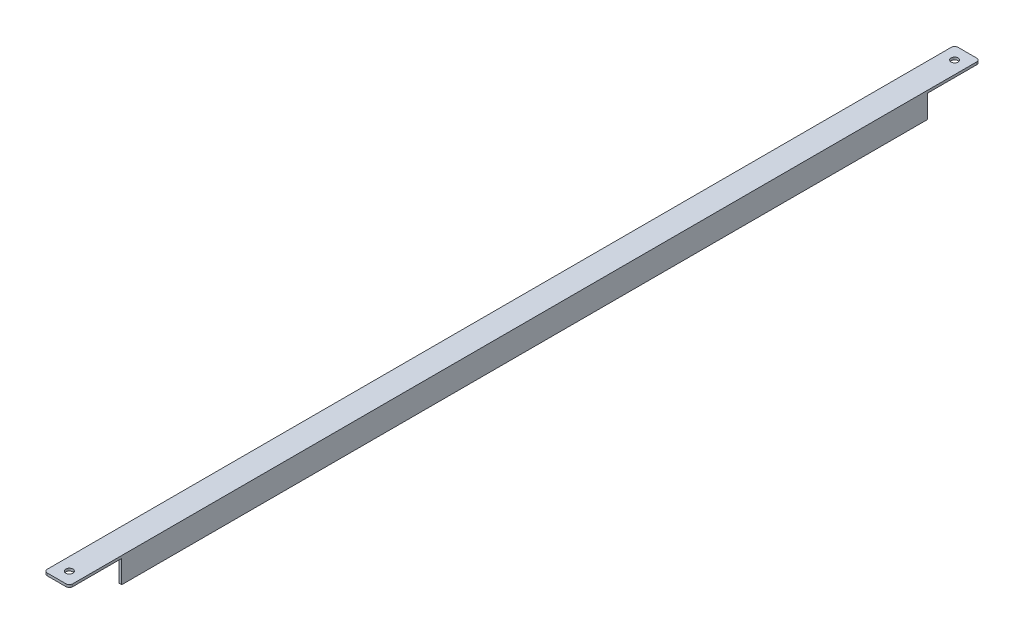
ISO-10303-21;
HEADER;
FILE_DESCRIPTION(('STEP AP214'),'2;1');
FILE_NAME('part.step','',(''),(''),'','','');
FILE_SCHEMA(('AUTOMOTIVE_DESIGN { 1 0 10303 214 1 1 1 1 }'));
ENDSEC;
DATA;
#1=APPLICATION_CONTEXT('core data for automotive mechanical design processes');
#2=APPLICATION_PROTOCOL_DEFINITION('international standard','automotive_design',2000,#1);
#3=PRODUCT_CONTEXT('',#1,'mechanical');
#4=PRODUCT('Part','Part','',(#3));
#5=PRODUCT_RELATED_PRODUCT_CATEGORY('part','',(#4));
#6=PRODUCT_DEFINITION_FORMATION('','',#4);
#7=PRODUCT_DEFINITION_CONTEXT('part definition',#1,'design');
#8=PRODUCT_DEFINITION('design','',#6,#7);
#9=PRODUCT_DEFINITION_SHAPE('','',#8);
#10=(LENGTH_UNIT() NAMED_UNIT(*) SI_UNIT(.MILLI.,.METRE.));
#11=(NAMED_UNIT(*) PLANE_ANGLE_UNIT() SI_UNIT($,.RADIAN.));
#12=(NAMED_UNIT(*) SI_UNIT($,.STERADIAN.) SOLID_ANGLE_UNIT());
#13=UNCERTAINTY_MEASURE_WITH_UNIT(LENGTH_MEASURE(1.E-05),#10,'distance_accuracy_value','');
#14=(GEOMETRIC_REPRESENTATION_CONTEXT(3) GLOBAL_UNCERTAINTY_ASSIGNED_CONTEXT((#13)) GLOBAL_UNIT_ASSIGNED_CONTEXT((#10,
#11,#12)) REPRESENTATION_CONTEXT('',''));
#15=CARTESIAN_POINT('',(0.,0.,0.));
#16=DIRECTION('',(0.,0.,1.));
#17=DIRECTION('',(1.,0.,0.));
#18=AXIS2_PLACEMENT_3D('',#15,#16,#17);
#19=CARTESIAN_POINT('',(-15.,-15.,539.));
#20=DIRECTION('',(0.,1.,0.));
#21=DIRECTION('',(0.,0.,1.));
#22=AXIS2_PLACEMENT_3D('',#19,#20,#21);
#23=PLANE('',#22);
#24=DIRECTION('',(1.,0.,0.));
#25=VECTOR('',#24,1.);
#26=CARTESIAN_POINT('',(-15.,-15.,477.));
#27=LINE('',#26,#25);
#28=CARTESIAN_POINT('',(12.,-15.,477.));
#29=VERTEX_POINT('',#28);
#30=CARTESIAN_POINT('',(15.,-15.,477.));
#31=VERTEX_POINT('',#30);
#32=EDGE_CURVE('E168',#29,#31,#27,.T.);
#33=ORIENTED_EDGE('',*,*,#32,.F.);
#34=DIRECTION('',(0.,0.,1.));
#35=VECTOR('',#34,1.);
#36=CARTESIAN_POINT('',(12.,-15.,-539.));
#37=LINE('',#36,#35);
#38=CARTESIAN_POINT('',(12.,-15.,-477.));
#39=VERTEX_POINT('',#38);
#40=EDGE_CURVE('E236',#39,#29,#37,.T.);
#41=ORIENTED_EDGE('',*,*,#40,.F.);
#42=DIRECTION('',(1.,0.,0.));
#43=VECTOR('',#42,1.);
#44=CARTESIAN_POINT('',(-15.,-15.,-477.));
#45=LINE('',#44,#43);
#46=CARTESIAN_POINT('',(15.,-15.,-477.));
#47=VERTEX_POINT('',#46);
#48=EDGE_CURVE('E259',#39,#47,#45,.T.);
#49=ORIENTED_EDGE('',*,*,#48,.T.);
#50=DIRECTION('',(0.,0.,-1.));
#51=VECTOR('',#50,1.);
#52=CARTESIAN_POINT('',(15.,-15.,539.));
#53=LINE('',#52,#51);
#54=EDGE_CURVE('E175',#31,#47,#53,.T.);
#55=ORIENTED_EDGE('',*,*,#54,.F.);
#56=EDGE_LOOP('',(#33,#41,#49,#55));
#57=FACE_BOUND('',#56,.T.);
#58=ADVANCED_FACE('F34',(#57),#23,.F.);
#59=CARTESIAN_POINT('',(15.,-15.,539.));
#60=DIRECTION('',(-1.,0.,0.));
#61=DIRECTION('',(0.,0.,1.));
#62=AXIS2_PLACEMENT_3D('',#59,#60,#61);
#63=PLANE('',#62);
#64=DIRECTION('',(0.,0.,-1.));
#65=VECTOR('',#64,1.);
#66=CARTESIAN_POINT('',(15.,15.,539.));
#67=LINE('',#66,#65);
#68=CARTESIAN_POINT('',(15.,15.,535.));
#69=VERTEX_POINT('',#68);
#70=CARTESIAN_POINT('',(15.,15.,-535.));
#71=VERTEX_POINT('',#70);
#72=EDGE_CURVE('E178',#69,#71,#67,.T.);
#73=ORIENTED_EDGE('',*,*,#72,.F.);
#74=DIRECTION('',(0.,1.,0.));
#75=VECTOR('',#74,1.);
#76=CARTESIAN_POINT('',(15.,-15.,535.));
#77=LINE('',#76,#75);
#78=CARTESIAN_POINT('',(15.,12.,535.));
#79=VERTEX_POINT('',#78);
#80=EDGE_CURVE('E212',#69,#79,#77,.F.);
#81=ORIENTED_EDGE('',*,*,#80,.T.);
#82=DIRECTION('',(0.,0.,-1.));
#83=VECTOR('',#82,1.);
#84=CARTESIAN_POINT('',(15.,12.,539.));
#85=LINE('',#84,#83);
#86=CARTESIAN_POINT('',(15.,12.,477.));
#87=VERTEX_POINT('',#86);
#88=EDGE_CURVE('E157',#79,#87,#85,.T.);
#89=ORIENTED_EDGE('',*,*,#88,.T.);
#90=DIRECTION('',(0.,-1.,0.));
#91=VECTOR('',#90,1.);
#92=CARTESIAN_POINT('',(15.,-15.,477.));
#93=LINE('',#92,#91);
#94=EDGE_CURVE('E190',#87,#31,#93,.T.);
#95=ORIENTED_EDGE('',*,*,#94,.T.);
#96=ORIENTED_EDGE('',*,*,#54,.T.);
#97=DIRECTION('',(0.,-1.,0.));
#98=VECTOR('',#97,1.);
#99=CARTESIAN_POINT('',(15.,-15.,-477.));
#100=LINE('',#99,#98);
#101=CARTESIAN_POINT('',(15.,12.,-477.));
#102=VERTEX_POINT('',#101);
#103=EDGE_CURVE('E244',#102,#47,#100,.T.);
#104=ORIENTED_EDGE('',*,*,#103,.F.);
#105=DIRECTION('',(0.,0.,1.));
#106=VECTOR('',#105,1.);
#107=CARTESIAN_POINT('',(15.,12.,-539.));
#108=LINE('',#107,#106);
#109=CARTESIAN_POINT('',(15.,12.,-535.));
#110=VERTEX_POINT('',#109);
#111=EDGE_CURVE('E249',#110,#102,#108,.T.);
#112=ORIENTED_EDGE('',*,*,#111,.F.);
#113=DIRECTION('',(0.,1.,0.));
#114=VECTOR('',#113,1.);
#115=CARTESIAN_POINT('',(15.,15.,-535.));
#116=LINE('',#115,#114);
#117=EDGE_CURVE('E209',#110,#71,#116,.T.);
#118=ORIENTED_EDGE('',*,*,#117,.T.);
#119=EDGE_LOOP('',(#73,#81,#89,#95,#96,#104,#112,#118));
#120=FACE_BOUND('',#119,.T.);
#121=ADVANCED_FACE('F317',(#120),#63,.F.);
#122=CARTESIAN_POINT('',(-15.,-15.,539.));
#123=DIRECTION('',(1.,0.,0.));
#124=DIRECTION('',(0.,0.,-1.));
#125=AXIS2_PLACEMENT_3D('',#122,#123,#124);
#126=PLANE('',#125);
#127=DIRECTION('',(0.,0.,-1.));
#128=VECTOR('',#127,1.);
#129=CARTESIAN_POINT('',(-15.,12.,539.));
#130=LINE('',#129,#128);
#131=CARTESIAN_POINT('',(-15.,12.,535.));
#132=VERTEX_POINT('',#131);
#133=CARTESIAN_POINT('',(-15.,12.,477.));
#134=VERTEX_POINT('',#133);
#135=EDGE_CURVE('E156',#132,#134,#130,.T.);
#136=ORIENTED_EDGE('',*,*,#135,.F.);
#137=DIRECTION('',(0.,-1.,0.));
#138=VECTOR('',#137,1.);
#139=CARTESIAN_POINT('',(-15.,-15.,535.));
#140=LINE('',#139,#138);
#141=CARTESIAN_POINT('',(-15.,15.,535.));
#142=VERTEX_POINT('',#141);
#143=EDGE_CURVE('E224',#132,#142,#140,.F.);
#144=ORIENTED_EDGE('',*,*,#143,.T.);
#145=DIRECTION('',(0.,0.,-1.));
#146=VECTOR('',#145,1.);
#147=CARTESIAN_POINT('',(-15.,15.,539.));
#148=LINE('',#147,#146);
#149=CARTESIAN_POINT('',(-15.,15.,-535.));
#150=VERTEX_POINT('',#149);
#151=EDGE_CURVE('E174',#142,#150,#148,.T.);
#152=ORIENTED_EDGE('',*,*,#151,.T.);
#153=DIRECTION('',(0.,-1.,0.));
#154=VECTOR('',#153,1.);
#155=CARTESIAN_POINT('',(-15.,12.,-535.));
#156=LINE('',#155,#154);
#157=CARTESIAN_POINT('',(-15.,12.,-535.));
#158=VERTEX_POINT('',#157);
#159=EDGE_CURVE('E221',#150,#158,#156,.T.);
#160=ORIENTED_EDGE('',*,*,#159,.T.);
#161=DIRECTION('',(0.,0.,1.));
#162=VECTOR('',#161,1.);
#163=CARTESIAN_POINT('',(-15.,12.,-539.));
#164=LINE('',#163,#162);
#165=CARTESIAN_POINT('',(-15.,12.,-477.));
#166=VERTEX_POINT('',#165);
#167=EDGE_CURVE('E238',#158,#166,#164,.T.);
#168=ORIENTED_EDGE('',*,*,#167,.T.);
#169=DIRECTION('',(0.,-1.,0.));
#170=VECTOR('',#169,1.);
#171=CARTESIAN_POINT('',(-15.,-15.,-477.));
#172=LINE('',#171,#170);
#173=CARTESIAN_POINT('',(-15.,-15.,-477.));
#174=VERTEX_POINT('',#173);
#175=EDGE_CURVE('E173',#166,#174,#172,.T.);
#176=ORIENTED_EDGE('',*,*,#175,.T.);
#177=DIRECTION('',(0.,0.,-1.));
#178=VECTOR('',#177,1.);
#179=CARTESIAN_POINT('',(-15.,-15.,539.));
#180=LINE('',#179,#178);
#181=CARTESIAN_POINT('',(-15.,-15.,477.));
#182=VERTEX_POINT('',#181);
#183=EDGE_CURVE('E163',#182,#174,#180,.T.);
#184=ORIENTED_EDGE('',*,*,#183,.F.);
#185=DIRECTION('',(0.,-1.,0.));
#186=VECTOR('',#185,1.);
#187=CARTESIAN_POINT('',(-15.,-15.,477.));
#188=LINE('',#187,#186);
#189=EDGE_CURVE('E146',#134,#182,#188,.T.);
#190=ORIENTED_EDGE('',*,*,#189,.F.);
#191=EDGE_LOOP('',(#136,#144,#152,#160,#168,#176,#184,#190));
#192=FACE_BOUND('',#191,.T.);
#193=ADVANCED_FACE('F171',(#192),#126,.F.);
#194=CARTESIAN_POINT('',(-12.,-15.,477.));
#195=VERTEX_POINT('',#194);
#196=EDGE_CURVE('E149',#182,#195,#27,.T.);
#197=ORIENTED_EDGE('',*,*,#196,.F.);
#198=ORIENTED_EDGE('',*,*,#183,.T.);
#199=CARTESIAN_POINT('',(-12.,-15.,-477.));
#200=VERTEX_POINT('',#199);
#201=EDGE_CURVE('E256',#174,#200,#45,.T.);
#202=ORIENTED_EDGE('',*,*,#201,.T.);
#203=DIRECTION('',(0.,0.,1.));
#204=VECTOR('',#203,1.);
#205=CARTESIAN_POINT('',(-12.,-15.,-539.));
#206=LINE('',#205,#204);
#207=EDGE_CURVE('E166',#200,#195,#206,.T.);
#208=ORIENTED_EDGE('',*,*,#207,.T.);
#209=EDGE_LOOP('',(#197,#198,#202,#208));
#210=FACE_BOUND('',#209,.T.);
#211=ADVANCED_FACE('F161',(#210),#23,.F.);
#212=CARTESIAN_POINT('',(0.,0.,539.));
#213=DIRECTION('',(0.,0.,-1.));
#214=DIRECTION('',(-1.,0.,0.));
#215=AXIS2_PLACEMENT_3D('',#212,#213,#214);
#216=PLANE('',#215);
#217=DIRECTION('',(-1.,0.,0.));
#218=VECTOR('',#217,1.);
#219=CARTESIAN_POINT('',(12.,12.,539.));
#220=LINE('',#219,#218);
#221=CARTESIAN_POINT('',(11.,12.,539.));
#222=VERTEX_POINT('',#221);
#223=CARTESIAN_POINT('',(-11.,12.,539.));
#224=VERTEX_POINT('',#223);
#225=EDGE_CURVE('E266',#222,#224,#220,.T.);
#226=ORIENTED_EDGE('',*,*,#225,.F.);
#227=DIRECTION('',(0.,1.,0.));
#228=VECTOR('',#227,1.);
#229=CARTESIAN_POINT('',(11.,0.,539.));
#230=LINE('',#229,#228);
#231=CARTESIAN_POINT('',(11.,15.,539.));
#232=VERTEX_POINT('',#231);
#233=EDGE_CURVE('E198',#222,#232,#230,.T.);
#234=ORIENTED_EDGE('',*,*,#233,.T.);
#235=DIRECTION('',(-1.,0.,0.));
#236=VECTOR('',#235,1.);
#237=CARTESIAN_POINT('',(-15.,15.,539.));
#238=LINE('',#237,#236);
#239=CARTESIAN_POINT('',(-11.,15.,539.));
#240=VERTEX_POINT('',#239);
#241=EDGE_CURVE('E180',#232,#240,#238,.T.);
#242=ORIENTED_EDGE('',*,*,#241,.T.);
#243=DIRECTION('',(0.,-1.,0.));
#244=VECTOR('',#243,1.);
#245=CARTESIAN_POINT('',(-11.,0.,539.));
#246=LINE('',#245,#244);
#247=EDGE_CURVE('E186',#240,#224,#246,.T.);
#248=ORIENTED_EDGE('',*,*,#247,.T.);
#249=EDGE_LOOP('',(#226,#234,#242,#248));
#250=FACE_BOUND('',#249,.T.);
#251=ADVANCED_FACE('F283',(#250),#216,.F.);
#252=CARTESIAN_POINT('',(12.,-15.,-539.));
#253=DIRECTION('',(1.,0.,0.));
#254=DIRECTION('',(0.,0.,-1.));
#255=AXIS2_PLACEMENT_3D('',#252,#253,#254);
#256=PLANE('',#255);
#257=DIRECTION('',(0.,-1.,0.));
#258=VECTOR('',#257,1.);
#259=CARTESIAN_POINT('',(12.,-15.,477.));
#260=LINE('',#259,#258);
#261=CARTESIAN_POINT('',(12.,12.,477.));
#262=VERTEX_POINT('',#261);
#263=EDGE_CURVE('E252',#262,#29,#260,.T.);
#264=ORIENTED_EDGE('',*,*,#263,.F.);
#265=DIRECTION('',(0.,0.,1.));
#266=VECTOR('',#265,1.);
#267=CARTESIAN_POINT('',(12.,12.,-539.));
#268=LINE('',#267,#266);
#269=CARTESIAN_POINT('',(12.,12.,-477.));
#270=VERTEX_POINT('',#269);
#271=EDGE_CURVE('E268',#270,#262,#268,.T.);
#272=ORIENTED_EDGE('',*,*,#271,.F.);
#273=DIRECTION('',(0.,-1.,0.));
#274=VECTOR('',#273,1.);
#275=CARTESIAN_POINT('',(12.,-15.,-477.));
#276=LINE('',#275,#274);
#277=EDGE_CURVE('E263',#270,#39,#276,.T.);
#278=ORIENTED_EDGE('',*,*,#277,.T.);
#279=ORIENTED_EDGE('',*,*,#40,.T.);
#280=EDGE_LOOP('',(#264,#272,#278,#279));
#281=FACE_BOUND('',#280,.T.);
#282=ADVANCED_FACE('F308',(#281),#256,.F.);
#283=CARTESIAN_POINT('',(-12.,-15.,-539.));
#284=DIRECTION('',(-1.,0.,0.));
#285=DIRECTION('',(0.,0.,1.));
#286=AXIS2_PLACEMENT_3D('',#283,#284,#285);
#287=PLANE('',#286);
#288=DIRECTION('',(0.,1.,0.));
#289=VECTOR('',#288,1.);
#290=CARTESIAN_POINT('',(-12.,-15.,477.));
#291=LINE('',#290,#289);
#292=CARTESIAN_POINT('',(-12.,12.,477.));
#293=VERTEX_POINT('',#292);
#294=EDGE_CURVE('E295',#195,#293,#291,.T.);
#295=ORIENTED_EDGE('',*,*,#294,.F.);
#296=ORIENTED_EDGE('',*,*,#207,.F.);
#297=DIRECTION('',(0.,1.,0.));
#298=VECTOR('',#297,1.);
#299=CARTESIAN_POINT('',(-12.,-15.,-477.));
#300=LINE('',#299,#298);
#301=CARTESIAN_POINT('',(-12.,12.,-477.));
#302=VERTEX_POINT('',#301);
#303=EDGE_CURVE('E258',#200,#302,#300,.T.);
#304=ORIENTED_EDGE('',*,*,#303,.T.);
#305=DIRECTION('',(0.,0.,1.));
#306=VECTOR('',#305,1.);
#307=CARTESIAN_POINT('',(-12.,12.,-539.));
#308=LINE('',#307,#306);
#309=EDGE_CURVE('E274',#302,#293,#308,.T.);
#310=ORIENTED_EDGE('',*,*,#309,.T.);
#311=EDGE_LOOP('',(#295,#296,#304,#310));
#312=FACE_BOUND('',#311,.T.);
#313=ADVANCED_FACE('F355',(#312),#287,.F.);
#314=CARTESIAN_POINT('',(-15.,15.,539.));
#315=DIRECTION('',(0.,-1.,0.));
#316=DIRECTION('',(0.,0.,-1.));
#317=AXIS2_PLACEMENT_3D('',#314,#315,#316);
#318=PLANE('',#317);
#319=CARTESIAN_POINT('',(0.,15.,524.));
#320=DIRECTION('',(0.,-1.,0.));
#321=DIRECTION('',(0.,0.,-1.));
#322=AXIS2_PLACEMENT_3D('',#319,#320,#321);
#323=CIRCLE('',#322,4.24999999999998);
#324=CARTESIAN_POINT('',(0.,15.,519.75));
#325=VERTEX_POINT('',#324);
#326=EDGE_CURVE('E195',#325,#325,#323,.T.);
#327=ORIENTED_EDGE('',*,*,#326,.T.);
#328=EDGE_LOOP('',(#327));
#329=FACE_BOUND('',#328,.T.);
#330=CARTESIAN_POINT('',(0.,15.,-524.));
#331=DIRECTION('',(0.,1.,0.));
#332=DIRECTION('',(0.,0.,1.));
#333=AXIS2_PLACEMENT_3D('',#330,#331,#332);
#334=CIRCLE('',#333,4.24999999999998);
#335=CARTESIAN_POINT('',(0.,15.,-519.75));
#336=VERTEX_POINT('',#335);
#337=EDGE_CURVE('E191',#336,#336,#334,.T.);
#338=ORIENTED_EDGE('',*,*,#337,.F.);
#339=EDGE_LOOP('',(#338));
#340=FACE_BOUND('',#339,.T.);
#341=ORIENTED_EDGE('',*,*,#241,.F.);
#342=CARTESIAN_POINT('',(11.,15.,535.));
#343=DIRECTION('',(0.,-1.,0.));
#344=DIRECTION('',(0.,0.,-1.));
#345=AXIS2_PLACEMENT_3D('',#342,#343,#344);
#346=CIRCLE('',#345,4.);
#347=EDGE_CURVE('E207',#232,#69,#346,.F.);
#348=ORIENTED_EDGE('',*,*,#347,.T.);
#349=ORIENTED_EDGE('',*,*,#72,.T.);
#350=CARTESIAN_POINT('',(11.,15.,-535.));
#351=DIRECTION('',(0.,-1.,0.));
#352=DIRECTION('',(0.,0.,-1.));
#353=AXIS2_PLACEMENT_3D('',#350,#351,#352);
#354=CIRCLE('',#353,4.);
#355=CARTESIAN_POINT('',(11.,15.,-539.));
#356=VERTEX_POINT('',#355);
#357=EDGE_CURVE('E203',#71,#356,#354,.F.);
#358=ORIENTED_EDGE('',*,*,#357,.T.);
#359=DIRECTION('',(-1.,0.,0.));
#360=VECTOR('',#359,1.);
#361=CARTESIAN_POINT('',(-15.,15.,-539.));
#362=LINE('',#361,#360);
#363=CARTESIAN_POINT('',(-11.,15.,-539.));
#364=VERTEX_POINT('',#363);
#365=EDGE_CURVE('E228',#356,#364,#362,.T.);
#366=ORIENTED_EDGE('',*,*,#365,.T.);
#367=CARTESIAN_POINT('',(-11.,15.,-535.));
#368=DIRECTION('',(0.,-1.,0.));
#369=DIRECTION('',(0.,0.,-1.));
#370=AXIS2_PLACEMENT_3D('',#367,#368,#369);
#371=CIRCLE('',#370,4.);
#372=EDGE_CURVE('E201',#364,#150,#371,.F.);
#373=ORIENTED_EDGE('',*,*,#372,.T.);
#374=ORIENTED_EDGE('',*,*,#151,.F.);
#375=CARTESIAN_POINT('',(-11.,15.,535.));
#376=DIRECTION('',(0.,-1.,0.));
#377=DIRECTION('',(0.,0.,-1.));
#378=AXIS2_PLACEMENT_3D('',#375,#376,#377);
#379=CIRCLE('',#378,4.);
#380=EDGE_CURVE('E205',#142,#240,#379,.F.);
#381=ORIENTED_EDGE('',*,*,#380,.T.);
#382=EDGE_LOOP('',(#341,#348,#349,#358,#366,#373,#374,#381));
#383=FACE_BOUND('',#382,.T.);
#384=ADVANCED_FACE('F234',(#329,#340,#383),#318,.F.);
#385=CARTESIAN_POINT('',(0.,0.,-539.));
#386=DIRECTION('',(0.,0.,-1.));
#387=DIRECTION('',(-1.,0.,0.));
#388=AXIS2_PLACEMENT_3D('',#385,#386,#387);
#389=PLANE('',#388);
#390=ORIENTED_EDGE('',*,*,#365,.F.);
#391=DIRECTION('',(0.,1.,0.));
#392=VECTOR('',#391,1.);
#393=CARTESIAN_POINT('',(11.,12.,-539.));
#394=LINE('',#393,#392);
#395=CARTESIAN_POINT('',(11.,12.,-539.));
#396=VERTEX_POINT('',#395);
#397=EDGE_CURVE('E11',#356,#396,#394,.F.);
#398=ORIENTED_EDGE('',*,*,#397,.T.);
#399=DIRECTION('',(-1.,0.,0.));
#400=VECTOR('',#399,1.);
#401=CARTESIAN_POINT('',(12.,12.,-539.));
#402=LINE('',#401,#400);
#403=CARTESIAN_POINT('',(-11.,12.,-539.));
#404=VERTEX_POINT('',#403);
#405=EDGE_CURVE('E229',#396,#404,#402,.T.);
#406=ORIENTED_EDGE('',*,*,#405,.T.);
#407=DIRECTION('',(0.,-1.,0.));
#408=VECTOR('',#407,1.);
#409=CARTESIAN_POINT('',(-11.,15.,-539.));
#410=LINE('',#409,#408);
#411=EDGE_CURVE('E42',#404,#364,#410,.F.);
#412=ORIENTED_EDGE('',*,*,#411,.T.);
#413=EDGE_LOOP('',(#390,#398,#406,#412));
#414=FACE_BOUND('',#413,.T.);
#415=ADVANCED_FACE('F227',(#414),#389,.T.);
#416=CARTESIAN_POINT('',(12.,12.,-539.));
#417=DIRECTION('',(0.,1.,0.));
#418=DIRECTION('',(-1.,0.,0.));
#419=AXIS2_PLACEMENT_3D('',#416,#417,#418);
#420=PLANE('',#419);
#421=CARTESIAN_POINT('',(0.,12.,524.));
#422=DIRECTION('',(0.,1.,0.));
#423=DIRECTION('',(-1.,0.,0.));
#424=AXIS2_PLACEMENT_3D('',#421,#422,#423);
#425=CIRCLE('',#424,4.24999999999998);
#426=CARTESIAN_POINT('',(-4.24999999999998,12.,524.));
#427=VERTEX_POINT('',#426);
#428=EDGE_CURVE('E192',#427,#427,#425,.F.);
#429=ORIENTED_EDGE('',*,*,#428,.F.);
#430=EDGE_LOOP('',(#429));
#431=FACE_BOUND('',#430,.T.);
#432=CARTESIAN_POINT('',(0.,12.,-524.));
#433=DIRECTION('',(0.,1.,0.));
#434=DIRECTION('',(-1.,0.,0.));
#435=AXIS2_PLACEMENT_3D('',#432,#433,#434);
#436=CIRCLE('',#435,4.24999999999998);
#437=CARTESIAN_POINT('',(-4.24999999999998,12.,-524.));
#438=VERTEX_POINT('',#437);
#439=EDGE_CURVE('E187',#438,#438,#436,.T.);
#440=ORIENTED_EDGE('',*,*,#439,.T.);
#441=EDGE_LOOP('',(#440));
#442=FACE_BOUND('',#441,.T.);
#443=ORIENTED_EDGE('',*,*,#88,.F.);
#444=CARTESIAN_POINT('',(11.,12.,535.));
#445=DIRECTION('',(0.,1.,0.));
#446=DIRECTION('',(-1.,0.,0.));
#447=AXIS2_PLACEMENT_3D('',#444,#445,#446);
#448=CIRCLE('',#447,4.);
#449=EDGE_CURVE('E219',#79,#222,#448,.F.);
#450=ORIENTED_EDGE('',*,*,#449,.T.);
#451=ORIENTED_EDGE('',*,*,#225,.T.);
#452=CARTESIAN_POINT('',(-11.,12.,535.));
#453=DIRECTION('',(0.,1.,0.));
#454=DIRECTION('',(-1.,0.,0.));
#455=AXIS2_PLACEMENT_3D('',#452,#453,#454);
#456=CIRCLE('',#455,4.);
#457=EDGE_CURVE('E217',#224,#132,#456,.F.);
#458=ORIENTED_EDGE('',*,*,#457,.T.);
#459=ORIENTED_EDGE('',*,*,#135,.T.);
#460=DIRECTION('',(1.,0.,0.));
#461=VECTOR('',#460,1.);
#462=CARTESIAN_POINT('',(-15.,12.,477.));
#463=LINE('',#462,#461);
#464=EDGE_CURVE('E152',#134,#293,#463,.T.);
#465=ORIENTED_EDGE('',*,*,#464,.T.);
#466=ORIENTED_EDGE('',*,*,#309,.F.);
#467=DIRECTION('',(1.,0.,0.));
#468=VECTOR('',#467,1.);
#469=CARTESIAN_POINT('',(-15.,12.,-477.));
#470=LINE('',#469,#468);
#471=EDGE_CURVE('E243',#166,#302,#470,.T.);
#472=ORIENTED_EDGE('',*,*,#471,.F.);
#473=ORIENTED_EDGE('',*,*,#167,.F.);
#474=CARTESIAN_POINT('',(-11.,12.,-535.));
#475=DIRECTION('',(0.,1.,0.));
#476=DIRECTION('',(-1.,0.,0.));
#477=AXIS2_PLACEMENT_3D('',#474,#475,#476);
#478=CIRCLE('',#477,4.);
#479=EDGE_CURVE('E49',#158,#404,#478,.F.);
#480=ORIENTED_EDGE('',*,*,#479,.T.);
#481=ORIENTED_EDGE('',*,*,#405,.F.);
#482=CARTESIAN_POINT('',(11.,12.,-535.));
#483=DIRECTION('',(0.,1.,0.));
#484=DIRECTION('',(-1.,0.,0.));
#485=AXIS2_PLACEMENT_3D('',#482,#483,#484);
#486=CIRCLE('',#485,4.);
#487=EDGE_CURVE('E215',#396,#110,#486,.F.);
#488=ORIENTED_EDGE('',*,*,#487,.T.);
#489=ORIENTED_EDGE('',*,*,#111,.T.);
#490=EDGE_CURVE('E246',#270,#102,#470,.T.);
#491=ORIENTED_EDGE('',*,*,#490,.F.);
#492=ORIENTED_EDGE('',*,*,#271,.T.);
#493=EDGE_CURVE('E167',#262,#87,#463,.T.);
#494=ORIENTED_EDGE('',*,*,#493,.T.);
#495=EDGE_LOOP('',(#443,#450,#451,#458,#459,#465,#466,#472,#473,#480,#481,#488,#489,#491,#492,#494));
#496=FACE_BOUND('',#495,.T.);
#497=ADVANCED_FACE('F241',(#431,#442,#496),#420,.F.);
#498=CARTESIAN_POINT('',(-15.,-15.,-477.));
#499=DIRECTION('',(0.,0.,1.));
#500=DIRECTION('',(1.,0.,0.));
#501=AXIS2_PLACEMENT_3D('',#498,#499,#500);
#502=PLANE('',#501);
#503=ORIENTED_EDGE('',*,*,#201,.F.);
#504=ORIENTED_EDGE('',*,*,#175,.F.);
#505=ORIENTED_EDGE('',*,*,#471,.T.);
#506=ORIENTED_EDGE('',*,*,#303,.F.);
#507=EDGE_LOOP('',(#503,#504,#505,#506));
#508=FACE_BOUND('',#507,.T.);
#509=ADVANCED_FACE('F376',(#508),#502,.F.);
#510=ORIENTED_EDGE('',*,*,#490,.T.);
#511=ORIENTED_EDGE('',*,*,#103,.T.);
#512=ORIENTED_EDGE('',*,*,#48,.F.);
#513=ORIENTED_EDGE('',*,*,#277,.F.);
#514=EDGE_LOOP('',(#510,#511,#512,#513));
#515=FACE_BOUND('',#514,.T.);
#516=ADVANCED_FACE('F312',(#515),#502,.F.);
#517=CARTESIAN_POINT('',(-15.,-15.,477.));
#518=DIRECTION('',(0.,0.,1.));
#519=DIRECTION('',(1.,0.,0.));
#520=AXIS2_PLACEMENT_3D('',#517,#518,#519);
#521=PLANE('',#520);
#522=ORIENTED_EDGE('',*,*,#294,.T.);
#523=ORIENTED_EDGE('',*,*,#464,.F.);
#524=ORIENTED_EDGE('',*,*,#189,.T.);
#525=ORIENTED_EDGE('',*,*,#196,.T.);
#526=EDGE_LOOP('',(#522,#523,#524,#525));
#527=FACE_BOUND('',#526,.T.);
#528=ADVANCED_FACE('F148',(#527),#521,.T.);
#529=ORIENTED_EDGE('',*,*,#263,.T.);
#530=ORIENTED_EDGE('',*,*,#32,.T.);
#531=ORIENTED_EDGE('',*,*,#94,.F.);
#532=ORIENTED_EDGE('',*,*,#493,.F.);
#533=EDGE_LOOP('',(#529,#530,#531,#532));
#534=FACE_BOUND('',#533,.T.);
#535=ADVANCED_FACE('F299',(#534),#521,.T.);
#536=CARTESIAN_POINT('',(0.,-15.,-524.));
#537=DIRECTION('',(0.,1.,0.));
#538=DIRECTION('',(0.,0.,1.));
#539=AXIS2_PLACEMENT_3D('',#536,#537,#538);
#540=CYLINDRICAL_SURFACE('',#539,4.24999999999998);
#541=ORIENTED_EDGE('',*,*,#337,.T.);
#542=EDGE_LOOP('',(#541));
#543=FACE_BOUND('',#542,.T.);
#544=ORIENTED_EDGE('',*,*,#439,.F.);
#545=EDGE_LOOP('',(#544));
#546=FACE_BOUND('',#545,.T.);
#547=ADVANCED_FACE('F334',(#543,#546),#540,.F.);
#548=CARTESIAN_POINT('',(0.,-15.,524.));
#549=DIRECTION('',(0.,1.,0.));
#550=DIRECTION('',(0.,0.,1.));
#551=AXIS2_PLACEMENT_3D('',#548,#549,#550);
#552=CYLINDRICAL_SURFACE('',#551,4.24999999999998);
#553=ORIENTED_EDGE('',*,*,#326,.F.);
#554=EDGE_LOOP('',(#553));
#555=FACE_BOUND('',#554,.T.);
#556=ORIENTED_EDGE('',*,*,#428,.T.);
#557=EDGE_LOOP('',(#556));
#558=FACE_BOUND('',#557,.T.);
#559=ADVANCED_FACE('F327',(#555,#558),#552,.F.);
#560=CARTESIAN_POINT('',(11.,0.,535.));
#561=DIRECTION('',(0.,1.,0.));
#562=DIRECTION('',(0.,0.,1.));
#563=AXIS2_PLACEMENT_3D('',#560,#561,#562);
#564=CYLINDRICAL_SURFACE('',#563,4.);
#565=ORIENTED_EDGE('',*,*,#449,.F.);
#566=ORIENTED_EDGE('',*,*,#80,.F.);
#567=ORIENTED_EDGE('',*,*,#347,.F.);
#568=ORIENTED_EDGE('',*,*,#233,.F.);
#569=EDGE_LOOP('',(#565,#566,#567,#568));
#570=FACE_BOUND('',#569,.T.);
#571=ADVANCED_FACE('F325',(#570),#564,.T.);
#572=CARTESIAN_POINT('',(-11.,0.,535.));
#573=DIRECTION('',(0.,-1.,0.));
#574=DIRECTION('',(0.,0.,-1.));
#575=AXIS2_PLACEMENT_3D('',#572,#573,#574);
#576=CYLINDRICAL_SURFACE('',#575,4.);
#577=ORIENTED_EDGE('',*,*,#380,.F.);
#578=ORIENTED_EDGE('',*,*,#143,.F.);
#579=ORIENTED_EDGE('',*,*,#457,.F.);
#580=ORIENTED_EDGE('',*,*,#247,.F.);
#581=EDGE_LOOP('',(#577,#578,#579,#580));
#582=FACE_BOUND('',#581,.T.);
#583=ADVANCED_FACE('F287',(#582),#576,.T.);
#584=CARTESIAN_POINT('',(11.,-15.,-535.));
#585=DIRECTION('',(0.,-1.,0.));
#586=DIRECTION('',(0.,0.,-1.));
#587=AXIS2_PLACEMENT_3D('',#584,#585,#586);
#588=CYLINDRICAL_SURFACE('',#587,4.);
#589=ORIENTED_EDGE('',*,*,#487,.F.);
#590=ORIENTED_EDGE('',*,*,#397,.F.);
#591=ORIENTED_EDGE('',*,*,#357,.F.);
#592=ORIENTED_EDGE('',*,*,#117,.F.);
#593=EDGE_LOOP('',(#589,#590,#591,#592));
#594=FACE_BOUND('',#593,.T.);
#595=ADVANCED_FACE('F323',(#594),#588,.T.);
#596=CARTESIAN_POINT('',(-11.,-15.,-535.));
#597=DIRECTION('',(0.,1.,0.));
#598=DIRECTION('',(0.,0.,1.));
#599=AXIS2_PLACEMENT_3D('',#596,#597,#598);
#600=CYLINDRICAL_SURFACE('',#599,4.);
#601=ORIENTED_EDGE('',*,*,#372,.F.);
#602=ORIENTED_EDGE('',*,*,#411,.F.);
#603=ORIENTED_EDGE('',*,*,#479,.F.);
#604=ORIENTED_EDGE('',*,*,#159,.F.);
#605=EDGE_LOOP('',(#601,#602,#603,#604));
#606=FACE_BOUND('',#605,.T.);
#607=ADVANCED_FACE('F36',(#606),#600,.T.);
#608=CLOSED_SHELL('',(#58,#121,#193,#211,#251,#282,#313,#384,#415,#497,#509,#516,#528,#535,#547,
#559,#571,#583,#595,#607));
#609=MANIFOLD_SOLID_BREP('B2',#608);
#610=ADVANCED_BREP_SHAPE_REPRESENTATION('',(#18,#609),#14);
#611=SHAPE_DEFINITION_REPRESENTATION(#9,#610);
ENDSEC;
END-ISO-10303-21;
